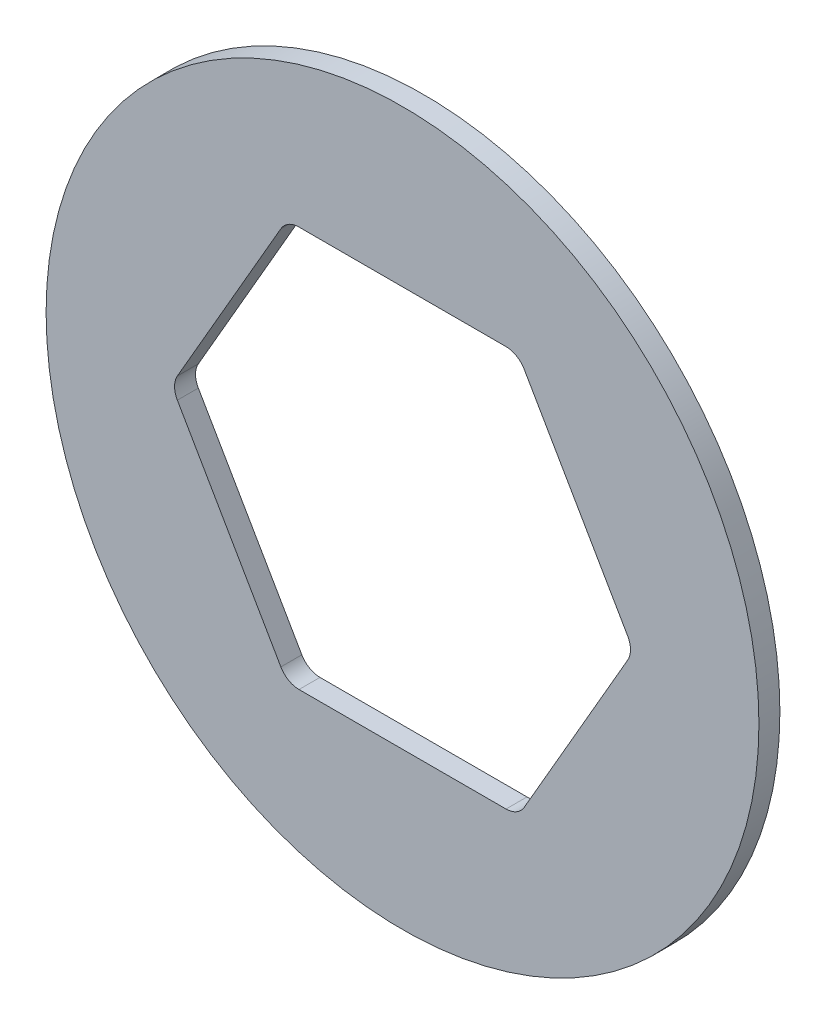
from build123d import *

# Parameters (mm, degrees)
ESQUISSE1_R        = 17
BOSS_EXTRU_1_DEPTH = 1
CONG_1_R           = 1


with BuildPart() as part:
    # Esquisse1 → Boss.-Extru.1 (new body)
    with BuildSketch(Plane.XY):
        Circle(ESQUISSE1_R)
        Polygon((5.513695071, -9.55), (11.027390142, 0), (5.513695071, 9.55), (-5.513695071, 9.55), (-11.027390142, 0), (-5.513695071, -9.55), align=None, mode=Mode.SUBTRACT)
    extrude(amount=BOSS_EXTRU_1_DEPTH)

    # Cong_1
    cong_1_edges = [part.edges().sort_by_distance(p)[0] for p in [
        (5.513695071, -9.55, 0.5),
        (11.027390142, 0, 0.5),
        (5.513695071, 9.55, 0.5),
        (-5.513695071, 9.55, 0.5),
        (-11.027390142, 0, 0.5),
        (-5.513695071, -9.55, 0.5),
    ]]
    fillet(cong_1_edges, radius=CONG_1_R)


solid = part.part
